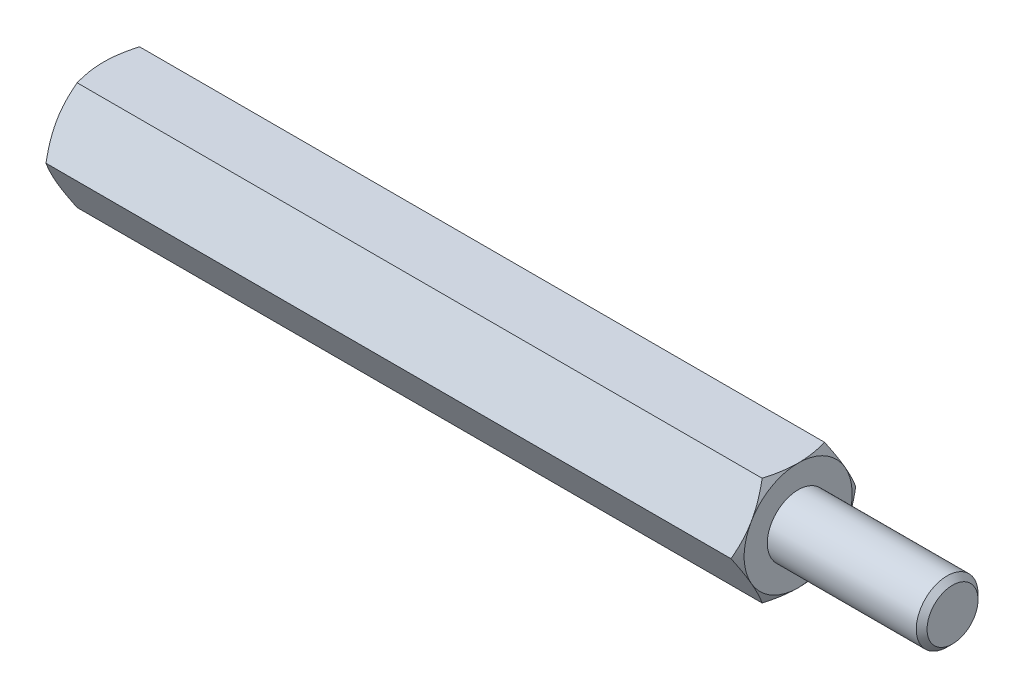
ISO-10303-21;
HEADER;
FILE_DESCRIPTION(('STEP AP214'),'2;1');
FILE_NAME('part.step','',(''),(''),'','','');
FILE_SCHEMA(('AUTOMOTIVE_DESIGN { 1 0 10303 214 1 1 1 1 }'));
ENDSEC;
DATA;
#1=APPLICATION_CONTEXT('core data for automotive mechanical design processes');
#2=APPLICATION_PROTOCOL_DEFINITION('international standard','automotive_design',2000,#1);
#3=PRODUCT_CONTEXT('',#1,'mechanical');
#4=PRODUCT('Part','Part','',(#3));
#5=PRODUCT_RELATED_PRODUCT_CATEGORY('part','',(#4));
#6=PRODUCT_DEFINITION_FORMATION('','',#4);
#7=PRODUCT_DEFINITION_CONTEXT('part definition',#1,'design');
#8=PRODUCT_DEFINITION('design','',#6,#7);
#9=PRODUCT_DEFINITION_SHAPE('','',#8);
#10=(LENGTH_UNIT() NAMED_UNIT(*) SI_UNIT(.MILLI.,.METRE.));
#11=(NAMED_UNIT(*) PLANE_ANGLE_UNIT() SI_UNIT($,.RADIAN.));
#12=(NAMED_UNIT(*) SI_UNIT($,.STERADIAN.) SOLID_ANGLE_UNIT());
#13=UNCERTAINTY_MEASURE_WITH_UNIT(LENGTH_MEASURE(1.E-05),#10,'distance_accuracy_value','');
#14=(GEOMETRIC_REPRESENTATION_CONTEXT(3) GLOBAL_UNCERTAINTY_ASSIGNED_CONTEXT((#13)) GLOBAL_UNIT_ASSIGNED_CONTEXT((#10,
#11,#12)) REPRESENTATION_CONTEXT('',''));
#15=CARTESIAN_POINT('',(0.,0.,0.));
#16=DIRECTION('',(0.,0.,1.));
#17=DIRECTION('',(1.,0.,0.));
#18=AXIS2_PLACEMENT_3D('',#15,#16,#17);
#19=CARTESIAN_POINT('',(22.5,3.5,-2.02072594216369));
#20=DIRECTION('',(1.,0.,0.));
#21=DIRECTION('',(0.,0.,-1.));
#22=AXIS2_PLACEMENT_3D('',#19,#20,#21);
#23=PLANE('',#22);
#24=CARTESIAN_POINT('',(22.5,0.,0.));
#25=DIRECTION('',(1.,0.,0.));
#26=DIRECTION('',(0.,0.,-1.));
#27=AXIS2_PLACEMENT_3D('',#24,#25,#26);
#28=CIRCLE('',#27,3.5);
#29=CARTESIAN_POINT('',(22.5,-1.75,-3.03108891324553));
#30=VERTEX_POINT('',#29);
#31=CARTESIAN_POINT('',(22.5,1.75,-3.03108891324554));
#32=VERTEX_POINT('',#31);
#33=EDGE_CURVE('E288',#30,#32,#28,.T.);
#34=ORIENTED_EDGE('',*,*,#33,.T.);
#35=CARTESIAN_POINT('',(22.5,3.5,0.));
#36=VERTEX_POINT('',#35);
#37=EDGE_CURVE('E53',#32,#36,#28,.T.);
#38=ORIENTED_EDGE('',*,*,#37,.T.);
#39=CARTESIAN_POINT('',(22.5,1.75,3.03108891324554));
#40=VERTEX_POINT('',#39);
#41=EDGE_CURVE('E297',#36,#40,#28,.T.);
#42=ORIENTED_EDGE('',*,*,#41,.T.);
#43=CARTESIAN_POINT('',(22.5,-1.75000000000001,3.03108891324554));
#44=VERTEX_POINT('',#43);
#45=EDGE_CURVE('E303',#40,#44,#28,.T.);
#46=ORIENTED_EDGE('',*,*,#45,.T.);
#47=CARTESIAN_POINT('',(22.5,0.,0.));
#48=DIRECTION('',(-1.,0.,0.));
#49=DIRECTION('',(0.,-1.,0.));
#50=AXIS2_PLACEMENT_3D('',#47,#48,#49);
#51=CIRCLE('',#50,3.5);
#52=CARTESIAN_POINT('',(22.5,-3.50000000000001,0.));
#53=VERTEX_POINT('',#52);
#54=EDGE_CURVE('E193',#53,#44,#51,.T.);
#55=ORIENTED_EDGE('',*,*,#54,.F.);
#56=EDGE_CURVE('E61',#53,#30,#28,.T.);
#57=ORIENTED_EDGE('',*,*,#56,.T.);
#58=EDGE_LOOP('',(#34,#38,#42,#46,#55,#57));
#59=FACE_BOUND('',#58,.T.);
#60=CARTESIAN_POINT('',(22.5,0.,0.));
#61=DIRECTION('',(1.,0.,0.));
#62=DIRECTION('',(0.,0.,-1.));
#63=AXIS2_PLACEMENT_3D('',#60,#61,#62);
#64=CIRCLE('',#63,2.);
#65=CARTESIAN_POINT('',(22.5,0.,-2.));
#66=VERTEX_POINT('',#65);
#67=EDGE_CURVE('E316',#66,#66,#64,.T.);
#68=ORIENTED_EDGE('',*,*,#67,.F.);
#69=EDGE_LOOP('',(#68));
#70=FACE_BOUND('',#69,.T.);
#71=ADVANCED_FACE('F37',(#59,#70),#23,.T.);
#72=CARTESIAN_POINT('',(22.5,0.,-4.04145188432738));
#73=DIRECTION('',(0.,-0.5,0.866025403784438));
#74=DIRECTION('',(0.,-0.866025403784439,-0.5));
#75=AXIS2_PLACEMENT_3D('',#72,#73,#74);
#76=PLANE('',#75);
#77=CARTESIAN_POINT('',(22.1873259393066,-0.000200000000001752,-4.04156735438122));
#78=CARTESIAN_POINT('',(22.23861421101,0.153607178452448,-3.9527667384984));
#79=CARTESIAN_POINT('',(22.2852590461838,0.308742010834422,-3.86319960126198));
#80=CARTESIAN_POINT('',(22.3666781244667,0.621698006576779,-3.68251437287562));
#81=CARTESIAN_POINT('',(22.4014235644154,0.779524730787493,-3.59139307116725));
#82=CARTESIAN_POINT('',(22.4555099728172,1.09322221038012,-3.41027974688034));
#83=CARTESIAN_POINT('',(22.4752109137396,1.24904469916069,-3.32031559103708));
#84=CARTESIAN_POINT('',(22.4987298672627,1.56142288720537,-3.13996396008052));
#85=CARTESIAN_POINT('',(22.5025673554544,1.71797745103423,-3.04957714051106));
#86=CARTESIAN_POINT('',(22.494584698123,2.01050921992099,-2.88068384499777));
#87=CARTESIAN_POINT('',(22.4847245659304,2.1465302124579,-2.80215208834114));
#88=CARTESIAN_POINT('',(22.4534735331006,2.41768602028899,-2.64560020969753));
#89=CARTESIAN_POINT('',(22.4320719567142,2.55281989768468,-2.5675806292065));
#90=CARTESIAN_POINT('',(22.3785695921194,2.82453479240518,-2.41070596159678));
#91=CARTESIAN_POINT('',(22.3462420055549,2.96108141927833,-2.33187072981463));
#92=CARTESIAN_POINT('',(22.272871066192,3.2321380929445,-2.17537608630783));
#93=CARTESIAN_POINT('',(22.2318449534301,3.36665161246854,-2.09771466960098));
#94=CARTESIAN_POINT('',(22.1873259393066,3.5002,-2.02061047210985));
#95=B_SPLINE_CURVE_WITH_KNOTS('',3,(#77,#78,#79,#80,#81,#82,#83,#84,#85,#86,#87,#88,#89,#90,#91,
#92,#93,#94),.UNSPECIFIED.,.F.,.F.,(4,2,2,2,2,2,2,2,4),(0.,0.554793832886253,1.11092123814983,
1.65328467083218,2.19498204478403,2.6666513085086,3.13875761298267,3.6213361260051,
4.10296698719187),.UNSPECIFIED.);
#96=CARTESIAN_POINT('',(22.1873926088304,0.,-4.04145188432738));
#97=VERTEX_POINT('',#96);
#98=EDGE_CURVE('E381',#97,#32,#95,.T.);
#99=ORIENTED_EDGE('',*,*,#98,.F.);
#100=DIRECTION('',(-1.,0.,0.));
#101=VECTOR('',#100,1.);
#102=CARTESIAN_POINT('',(22.5,0.,-4.04145188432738));
#103=LINE('',#102,#101);
#104=CARTESIAN_POINT('',(-22.1873926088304,0.,-4.04145188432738));
#105=VERTEX_POINT('',#104);
#106=EDGE_CURVE('E264',#97,#105,#103,.T.);
#107=ORIENTED_EDGE('',*,*,#106,.T.);
#108=CARTESIAN_POINT('',(-22.1873259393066,3.5002,-2.02061047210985));
#109=CARTESIAN_POINT('',(-22.23861421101,3.34639282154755,-2.10941108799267));
#110=CARTESIAN_POINT('',(-22.2852590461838,3.19125798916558,-2.19897822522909));
#111=CARTESIAN_POINT('',(-22.3666781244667,2.87830199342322,-2.37966345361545));
#112=CARTESIAN_POINT('',(-22.4014235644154,2.7204752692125,-2.47078475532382));
#113=CARTESIAN_POINT('',(-22.4555099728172,2.40677778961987,-2.65189807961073));
#114=CARTESIAN_POINT('',(-22.4752109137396,2.25095530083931,-2.74186223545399));
#115=CARTESIAN_POINT('',(-22.4987298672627,1.93857711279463,-2.92221386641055));
#116=CARTESIAN_POINT('',(-22.5025673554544,1.78202254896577,-3.01260068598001));
#117=CARTESIAN_POINT('',(-22.494584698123,1.48949078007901,-3.1814939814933));
#118=CARTESIAN_POINT('',(-22.4847245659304,1.35346978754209,-3.26002573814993));
#119=CARTESIAN_POINT('',(-22.4534735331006,1.082313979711,-3.41657761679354));
#120=CARTESIAN_POINT('',(-22.4320719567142,0.947180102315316,-3.49459719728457));
#121=CARTESIAN_POINT('',(-22.3785695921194,0.675465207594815,-3.65147186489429));
#122=CARTESIAN_POINT('',(-22.3462420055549,0.538918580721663,-3.73030709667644));
#123=CARTESIAN_POINT('',(-22.272871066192,0.267861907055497,-3.88680174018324));
#124=CARTESIAN_POINT('',(-22.2318449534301,0.133348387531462,-3.96446315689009));
#125=CARTESIAN_POINT('',(-22.1873259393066,-0.000200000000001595,-4.04156735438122));
#126=B_SPLINE_CURVE_WITH_KNOTS('',3,(#108,#109,#110,#111,#112,#113,#114,#115,#116,#117,#118,
#119,#120,#121,#122,#123,#124,#125),.UNSPECIFIED.,.F.,.F.,(4,2,2,2,2,2,2,2,4),(0.,
0.554793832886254,1.11092123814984,1.65328467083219,2.19498204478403,2.6666513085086,
3.13875761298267,3.6213361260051,4.10296698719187),.UNSPECIFIED.);
#127=CARTESIAN_POINT('',(-22.5,1.75,-3.03108891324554));
#128=VERTEX_POINT('',#127);
#129=EDGE_CURVE('E361',#128,#105,#126,.T.);
#130=ORIENTED_EDGE('',*,*,#129,.F.);
#131=CARTESIAN_POINT('',(-22.1873926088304,3.5,-2.02072594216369));
#132=VERTEX_POINT('',#131);
#133=EDGE_CURVE('E350',#132,#128,#126,.T.);
#134=ORIENTED_EDGE('',*,*,#133,.F.);
#135=DIRECTION('',(-1.,0.,0.));
#136=VECTOR('',#135,1.);
#137=CARTESIAN_POINT('',(22.5,3.5,-2.02072594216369));
#138=LINE('',#137,#136);
#139=CARTESIAN_POINT('',(22.1873926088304,3.5,-2.02072594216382));
#140=VERTEX_POINT('',#139);
#141=EDGE_CURVE('E279',#140,#132,#138,.T.);
#142=ORIENTED_EDGE('',*,*,#141,.F.);
#143=EDGE_CURVE('E229',#32,#140,#95,.T.);
#144=ORIENTED_EDGE('',*,*,#143,.F.);
#145=EDGE_LOOP('',(#99,#107,#130,#134,#142,#144));
#146=FACE_BOUND('',#145,.T.);
#147=ADVANCED_FACE('F148',(#146),#76,.F.);
#148=CARTESIAN_POINT('',(22.5,3.5,-2.02072594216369));
#149=DIRECTION('',(0.,-1.,0.));
#150=DIRECTION('',(0.,0.,-1.));
#151=AXIS2_PLACEMENT_3D('',#148,#149,#150);
#152=PLANE('',#151);
#153=CARTESIAN_POINT('',(20.7443294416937,3.5,-5.525713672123));
#154=CARTESIAN_POINT('',(20.8192813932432,3.5,-5.37200190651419));
#155=CARTESIAN_POINT('',(20.8935424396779,3.5,-5.21794762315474));
#156=CARTESIAN_POINT('',(21.0402960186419,3.5,-4.90897223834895));
#157=CARTESIAN_POINT('',(21.1127882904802,3.5,-4.75405101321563));
#158=CARTESIAN_POINT('',(21.2559617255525,3.5,-4.44240758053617));
#159=CARTESIAN_POINT('',(21.3266316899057,3.5,-4.28568021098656));
#160=CARTESIAN_POINT('',(21.4652074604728,3.5,-3.97101270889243));
#161=CARTESIAN_POINT('',(21.5331133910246,3.5,-3.81307263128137));
#162=CARTESIAN_POINT('',(21.6677143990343,3.5,-3.49026114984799));
#163=CARTESIAN_POINT('',(21.7342871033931,3.5,-3.32533845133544));
#164=CARTESIAN_POINT('',(21.8626267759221,3.5,-2.99359992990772));
#165=CARTESIAN_POINT('',(21.9243932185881,3.5,-2.82678390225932));
#166=CARTESIAN_POINT('',(22.0415700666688,3.5,-2.49127529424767));
#167=CARTESIAN_POINT('',(22.0969925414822,3.5,-2.32258697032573));
#168=CARTESIAN_POINT('',(22.1997679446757,3.5,-1.98279215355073));
#169=CARTESIAN_POINT('',(22.2471233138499,3.5,-1.81168640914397));
#170=CARTESIAN_POINT('',(22.3312987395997,3.5,-1.46793354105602));
#171=CARTESIAN_POINT('',(22.3681796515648,3.5,-1.2953015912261));
#172=CARTESIAN_POINT('',(22.4293955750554,3.5,-0.94779164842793));
#173=CARTESIAN_POINT('',(22.453731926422,3.5,-0.772913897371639));
#174=CARTESIAN_POINT('',(22.4876038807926,3.5,-0.424108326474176));
#175=CARTESIAN_POINT('',(22.497337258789,3.5,-0.250200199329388));
#176=CARTESIAN_POINT('',(22.5017053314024,3.5,0.0978233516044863));
#177=CARTESIAN_POINT('',(22.4963399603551,3.5,0.271938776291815));
#178=CARTESIAN_POINT('',(22.4750118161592,3.5,0.564711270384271));
#179=CARTESIAN_POINT('',(22.4628919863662,3.5,0.683667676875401));
#180=CARTESIAN_POINT('',(22.4323080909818,3.5,0.920767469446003));
#181=CARTESIAN_POINT('',(22.4138432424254,3.5,1.03891075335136));
#182=CARTESIAN_POINT('',(22.3498956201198,3.5,1.39193174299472));
#183=CARTESIAN_POINT('',(22.2958695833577,3.5,1.62528232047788));
#184=CARTESIAN_POINT('',(22.2014515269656,3.5,1.97433825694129));
#185=CARTESIAN_POINT('',(22.1672900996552,3.5,2.09183268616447));
#186=CARTESIAN_POINT('',(22.095234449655,3.5,2.32568238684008));
#187=CARTESIAN_POINT('',(22.0573401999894,3.5,2.44203765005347));
#188=CARTESIAN_POINT('',(21.9784421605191,3.5,2.6736423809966));
#189=CARTESIAN_POINT('',(21.9374392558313,3.5,2.78889215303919));
#190=CARTESIAN_POINT('',(21.852824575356,3.5,3.01842460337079));
#191=CARTESIAN_POINT('',(21.8092128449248,3.5,3.1327072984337));
#192=CARTESIAN_POINT('',(21.6958241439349,3.5,3.42150510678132));
#193=CARTESIAN_POINT('',(21.6245636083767,3.5,3.59543696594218));
#194=CARTESIAN_POINT('',(21.4781026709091,3.5,3.94163961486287));
#195=CARTESIAN_POINT('',(21.4029019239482,3.5,4.11391025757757));
#196=CARTESIAN_POINT('',(21.2494252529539,3.5,4.45713072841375));
#197=CARTESIAN_POINT('',(21.1711484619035,3.5,4.62808016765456));
#198=CARTESIAN_POINT('',(21.012188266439,3.5,4.96885843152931));
#199=CARTESIAN_POINT('',(20.9315047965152,3.5,5.13868722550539));
#200=CARTESIAN_POINT('',(20.6863871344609,3.5,5.64726192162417));
#201=CARTESIAN_POINT('',(20.5190975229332,3.5,5.98463020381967));
#202=CARTESIAN_POINT('',(20.1795854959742,3.5,6.65678495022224));
#203=CARTESIAN_POINT('',(20.0073639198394,3.5,6.99157184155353));
#204=CARTESIAN_POINT('',(19.6760800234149,3.5,7.62749570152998));
#205=CARTESIAN_POINT('',(19.5173299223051,3.5,7.92879562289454));
#206=CARTESIAN_POINT('',(19.1977473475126,3.5,8.53030635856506));
#207=CARTESIAN_POINT('',(19.0369147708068,3.5,8.83051711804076));
#208=CARTESIAN_POINT('',(18.7141792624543,3.5,9.42918006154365));
#209=CARTESIAN_POINT('',(18.5522810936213,3.5,9.72763481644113));
#210=CARTESIAN_POINT('',(18.2272737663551,3.5,10.3238577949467));
#211=CARTESIAN_POINT('',(18.0641646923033,3.5,10.6216260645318));
#212=CARTESIAN_POINT('',(17.9006104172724,3.5,10.9191478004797));
#213=B_SPLINE_CURVE_WITH_KNOTS('',3,(#153,#154,#155,#156,#157,#158,#159,#160,#161,#162,#163,
#164,#165,#166,#167,#168,#169,#170,#171,#172,#173,#174,#175,#176,#177,#178,#179,#180,#181,#182,
#183,#184,#185,#186,#187,#188,#189,#190,#191,#192,#193,#194,#195,#196,#197,#198,#199,#200,#201,
#202,#203,#204,#205,#206,#207,#208,#209,#210,#211,#212),.UNSPECIFIED.,.F.,.F.,(4,2,2,2,2,2,2,2,
2,2,2,2,2,2,2,2,2,2,2,2,2,2,2,2,2,2,2,2,2,4),(0.,0.513041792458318,1.02615874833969,
1.54190801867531,2.05763406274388,2.59113284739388,3.1246898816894,3.65721433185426,
4.18957737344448,4.71878103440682,5.24792816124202,5.76984197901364,6.29175806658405,
6.6503025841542,7.00889136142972,7.72642330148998,8.0934692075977,8.46051776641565,
8.82746220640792,9.19440026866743,9.75822236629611,10.3220939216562,10.8861255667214,
11.4501725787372,12.579801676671,13.7092396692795,14.730918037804,15.7526471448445,
16.771258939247,17.7898004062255),.UNSPECIFIED.);
#214=EDGE_CURVE('E227',#140,#36,#213,.T.);
#215=ORIENTED_EDGE('',*,*,#214,.F.);
#216=ORIENTED_EDGE('',*,*,#141,.T.);
#217=CARTESIAN_POINT('',(-20.7443294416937,3.5,-5.525713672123));
#218=CARTESIAN_POINT('',(-20.8192813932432,3.5,-5.37200190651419));
#219=CARTESIAN_POINT('',(-20.8935424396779,3.5,-5.21794762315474));
#220=CARTESIAN_POINT('',(-21.0402960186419,3.5,-4.90897223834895));
#221=CARTESIAN_POINT('',(-21.1127882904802,3.5,-4.75405101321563));
#222=CARTESIAN_POINT('',(-21.2559617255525,3.5,-4.44240758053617));
#223=CARTESIAN_POINT('',(-21.3266316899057,3.5,-4.28568021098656));
#224=CARTESIAN_POINT('',(-21.4652074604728,3.5,-3.97101270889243));
#225=CARTESIAN_POINT('',(-21.5331133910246,3.5,-3.81307263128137));
#226=CARTESIAN_POINT('',(-21.6677143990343,3.5,-3.49026114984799));
#227=CARTESIAN_POINT('',(-21.7342871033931,3.5,-3.32533845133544));
#228=CARTESIAN_POINT('',(-21.8626267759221,3.5,-2.99359992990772));
#229=CARTESIAN_POINT('',(-21.9243932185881,3.5,-2.82678390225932));
#230=CARTESIAN_POINT('',(-22.0415700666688,3.5,-2.49127529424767));
#231=CARTESIAN_POINT('',(-22.0969925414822,3.5,-2.32258697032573));
#232=CARTESIAN_POINT('',(-22.1997679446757,3.5,-1.98279215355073));
#233=CARTESIAN_POINT('',(-22.2471233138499,3.5,-1.81168640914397));
#234=CARTESIAN_POINT('',(-22.3312987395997,3.5,-1.46793354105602));
#235=CARTESIAN_POINT('',(-22.3681796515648,3.5,-1.2953015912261));
#236=CARTESIAN_POINT('',(-22.4293955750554,3.5,-0.94779164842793));
#237=CARTESIAN_POINT('',(-22.453731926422,3.5,-0.772913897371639));
#238=CARTESIAN_POINT('',(-22.4876038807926,3.5,-0.424108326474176));
#239=CARTESIAN_POINT('',(-22.497337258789,3.5,-0.250200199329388));
#240=CARTESIAN_POINT('',(-22.5017053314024,3.5,0.0978233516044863));
#241=CARTESIAN_POINT('',(-22.4963399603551,3.5,0.271938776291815));
#242=CARTESIAN_POINT('',(-22.4750118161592,3.5,0.564711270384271));
#243=CARTESIAN_POINT('',(-22.4628919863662,3.5,0.683667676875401));
#244=CARTESIAN_POINT('',(-22.4323080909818,3.5,0.920767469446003));
#245=CARTESIAN_POINT('',(-22.4138432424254,3.5,1.03891075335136));
#246=CARTESIAN_POINT('',(-22.3498956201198,3.5,1.39193174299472));
#247=CARTESIAN_POINT('',(-22.2958695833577,3.5,1.62528232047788));
#248=CARTESIAN_POINT('',(-22.2014515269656,3.5,1.97433825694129));
#249=CARTESIAN_POINT('',(-22.1672900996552,3.5,2.09183268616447));
#250=CARTESIAN_POINT('',(-22.095234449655,3.5,2.32568238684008));
#251=CARTESIAN_POINT('',(-22.0573401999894,3.5,2.44203765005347));
#252=CARTESIAN_POINT('',(-21.9784421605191,3.5,2.6736423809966));
#253=CARTESIAN_POINT('',(-21.9374392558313,3.5,2.78889215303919));
#254=CARTESIAN_POINT('',(-21.852824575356,3.5,3.01842460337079));
#255=CARTESIAN_POINT('',(-21.8092128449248,3.5,3.1327072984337));
#256=CARTESIAN_POINT('',(-21.6958241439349,3.5,3.42150510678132));
#257=CARTESIAN_POINT('',(-21.6245636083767,3.5,3.59543696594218));
#258=CARTESIAN_POINT('',(-21.4781026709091,3.5,3.94163961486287));
#259=CARTESIAN_POINT('',(-21.4029019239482,3.5,4.11391025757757));
#260=CARTESIAN_POINT('',(-21.2494252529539,3.5,4.45713072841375));
#261=CARTESIAN_POINT('',(-21.1711484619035,3.5,4.62808016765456));
#262=CARTESIAN_POINT('',(-21.012188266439,3.5,4.96885843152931));
#263=CARTESIAN_POINT('',(-20.9315047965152,3.5,5.13868722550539));
#264=CARTESIAN_POINT('',(-20.6863871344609,3.5,5.64726192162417));
#265=CARTESIAN_POINT('',(-20.5190975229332,3.5,5.98463020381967));
#266=CARTESIAN_POINT('',(-20.1795854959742,3.5,6.65678495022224));
#267=CARTESIAN_POINT('',(-20.0073639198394,3.5,6.99157184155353));
#268=CARTESIAN_POINT('',(-19.6760800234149,3.5,7.62749570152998));
#269=CARTESIAN_POINT('',(-19.5173299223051,3.5,7.92879562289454));
#270=CARTESIAN_POINT('',(-19.1977473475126,3.5,8.53030635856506));
#271=CARTESIAN_POINT('',(-19.0369147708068,3.5,8.83051711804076));
#272=CARTESIAN_POINT('',(-18.7141792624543,3.5,9.42918006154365));
#273=CARTESIAN_POINT('',(-18.5522810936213,3.5,9.72763481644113));
#274=CARTESIAN_POINT('',(-18.2272737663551,3.5,10.3238577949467));
#275=CARTESIAN_POINT('',(-18.0641646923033,3.5,10.6216260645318));
#276=CARTESIAN_POINT('',(-17.9006104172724,3.5,10.9191478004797));
#277=B_SPLINE_CURVE_WITH_KNOTS('',3,(#217,#218,#219,#220,#221,#222,#223,#224,#225,#226,#227,
#228,#229,#230,#231,#232,#233,#234,#235,#236,#237,#238,#239,#240,#241,#242,#243,#244,#245,#246,
#247,#248,#249,#250,#251,#252,#253,#254,#255,#256,#257,#258,#259,#260,#261,#262,#263,#264,#265,
#266,#267,#268,#269,#270,#271,#272,#273,#274,#275,#276),.UNSPECIFIED.,.F.,.F.,(4,2,2,2,2,2,2,2,
2,2,2,2,2,2,2,2,2,2,2,2,2,2,2,2,2,2,2,2,2,4),(0.,0.513041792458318,1.02615874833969,
1.54190801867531,2.05763406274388,2.59113284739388,3.1246898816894,3.65721433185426,
4.18957737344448,4.71878103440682,5.24792816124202,5.76984197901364,6.29175806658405,
6.6503025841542,7.00889136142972,7.72642330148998,8.0934692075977,8.46051776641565,
8.82746220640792,9.19440026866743,9.75822236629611,10.3220939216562,10.8861255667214,
11.4501725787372,12.579801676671,13.7092396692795,14.730918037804,15.7526471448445,
16.771258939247,17.7898004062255),.UNSPECIFIED.);
#278=CARTESIAN_POINT('',(-22.5,3.5,0.));
#279=VERTEX_POINT('',#278);
#280=EDGE_CURVE('E241',#279,#132,#277,.F.);
#281=ORIENTED_EDGE('',*,*,#280,.F.);
#282=CARTESIAN_POINT('',(-22.1873926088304,3.5,2.02072594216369));
#283=VERTEX_POINT('',#282);
#284=EDGE_CURVE('E249',#283,#279,#277,.F.);
#285=ORIENTED_EDGE('',*,*,#284,.F.);
#286=DIRECTION('',(-1.,0.,0.));
#287=VECTOR('',#286,1.);
#288=CARTESIAN_POINT('',(22.5,3.5,2.02072594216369));
#289=LINE('',#288,#287);
#290=CARTESIAN_POINT('',(22.1873926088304,3.5,2.02072594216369));
#291=VERTEX_POINT('',#290);
#292=EDGE_CURVE('E276',#291,#283,#289,.T.);
#293=ORIENTED_EDGE('',*,*,#292,.F.);
#294=EDGE_CURVE('E221',#36,#291,#213,.T.);
#295=ORIENTED_EDGE('',*,*,#294,.F.);
#296=EDGE_LOOP('',(#215,#216,#281,#285,#293,#295));
#297=FACE_BOUND('',#296,.T.);
#298=ADVANCED_FACE('F153',(#297),#152,.F.);
#299=CARTESIAN_POINT('',(22.5,3.5,2.02072594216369));
#300=DIRECTION('',(0.,-0.5,-0.866025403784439));
#301=DIRECTION('',(0.,0.866025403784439,-0.5));
#302=AXIS2_PLACEMENT_3D('',#299,#300,#301);
#303=PLANE('',#302);
#304=CARTESIAN_POINT('',(22.1873259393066,3.5002,2.02061047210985));
#305=CARTESIAN_POINT('',(22.23861421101,3.34639282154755,2.10941108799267));
#306=CARTESIAN_POINT('',(22.2852590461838,3.19125798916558,2.19897822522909));
#307=CARTESIAN_POINT('',(22.3666781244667,2.87830199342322,2.37966345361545));
#308=CARTESIAN_POINT('',(22.4014235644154,2.7204752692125,2.47078475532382));
#309=CARTESIAN_POINT('',(22.4555099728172,2.40677778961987,2.65189807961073));
#310=CARTESIAN_POINT('',(22.4752109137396,2.25095530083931,2.74186223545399));
#311=CARTESIAN_POINT('',(22.4987298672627,1.93857711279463,2.92221386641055));
#312=CARTESIAN_POINT('',(22.5025673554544,1.78202254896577,3.01260068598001));
#313=CARTESIAN_POINT('',(22.494584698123,1.48949078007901,3.1814939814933));
#314=CARTESIAN_POINT('',(22.4847245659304,1.35346978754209,3.26002573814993));
#315=CARTESIAN_POINT('',(22.4534735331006,1.08231397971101,3.41657761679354));
#316=CARTESIAN_POINT('',(22.4320719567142,0.947180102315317,3.49459719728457));
#317=CARTESIAN_POINT('',(22.3785695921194,0.675465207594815,3.65147186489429));
#318=CARTESIAN_POINT('',(22.3462420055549,0.538918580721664,3.73030709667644));
#319=CARTESIAN_POINT('',(22.272871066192,0.267861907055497,3.88680174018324));
#320=CARTESIAN_POINT('',(22.2318449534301,0.133348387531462,3.96446315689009));
#321=CARTESIAN_POINT('',(22.1873259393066,-0.000200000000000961,4.04156735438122));
#322=B_SPLINE_CURVE_WITH_KNOTS('',3,(#304,#305,#306,#307,#308,#309,#310,#311,#312,#313,#314,
#315,#316,#317,#318,#319,#320,#321),.UNSPECIFIED.,.F.,.F.,(4,2,2,2,2,2,2,2,4),(0.,
0.554793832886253,1.11092123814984,1.65328467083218,2.19498204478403,2.6666513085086,
3.13875761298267,3.6213361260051,4.10296698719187),.UNSPECIFIED.);
#323=EDGE_CURVE('E228',#291,#40,#322,.T.);
#324=ORIENTED_EDGE('',*,*,#323,.F.);
#325=ORIENTED_EDGE('',*,*,#292,.T.);
#326=CARTESIAN_POINT('',(-22.1873259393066,-0.000200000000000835,4.04156735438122));
#327=CARTESIAN_POINT('',(-22.23861421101,0.153607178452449,3.9527667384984));
#328=CARTESIAN_POINT('',(-22.2852590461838,0.308742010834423,3.86319960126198));
#329=CARTESIAN_POINT('',(-22.3666781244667,0.62169800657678,3.68251437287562));
#330=CARTESIAN_POINT('',(-22.4014235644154,0.779524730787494,3.59139307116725));
#331=CARTESIAN_POINT('',(-22.4555099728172,1.09322221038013,3.41027974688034));
#332=CARTESIAN_POINT('',(-22.4752109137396,1.24904469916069,3.32031559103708));
#333=CARTESIAN_POINT('',(-22.4987298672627,1.56142288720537,3.13996396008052));
#334=CARTESIAN_POINT('',(-22.5025673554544,1.71797745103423,3.04957714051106));
#335=CARTESIAN_POINT('',(-22.494584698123,2.01050921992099,2.88068384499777));
#336=CARTESIAN_POINT('',(-22.4847245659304,2.1465302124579,2.80215208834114));
#337=CARTESIAN_POINT('',(-22.4534735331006,2.41768602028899,2.64560020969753));
#338=CARTESIAN_POINT('',(-22.4320719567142,2.55281989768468,2.5675806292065));
#339=CARTESIAN_POINT('',(-22.3785695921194,2.82453479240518,2.41070596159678));
#340=CARTESIAN_POINT('',(-22.3462420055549,2.96108141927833,2.33187072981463));
#341=CARTESIAN_POINT('',(-22.272871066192,3.2321380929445,2.17537608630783));
#342=CARTESIAN_POINT('',(-22.2318449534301,3.36665161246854,2.09771466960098));
#343=CARTESIAN_POINT('',(-22.1873259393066,3.5002,2.02061047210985));
#344=B_SPLINE_CURVE_WITH_KNOTS('',3,(#326,#327,#328,#329,#330,#331,#332,#333,#334,#335,#336,
#337,#338,#339,#340,#341,#342,#343),.UNSPECIFIED.,.F.,.F.,(4,2,2,2,2,2,2,2,4),(0.,
0.554793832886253,1.11092123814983,1.65328467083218,2.19498204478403,2.6666513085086,
3.13875761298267,3.62133612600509,4.10296698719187),.UNSPECIFIED.);
#345=CARTESIAN_POINT('',(-22.5,1.75,3.03108891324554));
#346=VERTEX_POINT('',#345);
#347=EDGE_CURVE('E255',#346,#283,#344,.T.);
#348=ORIENTED_EDGE('',*,*,#347,.F.);
#349=CARTESIAN_POINT('',(-22.1873926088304,0.,4.04145188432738));
#350=VERTEX_POINT('',#349);
#351=EDGE_CURVE('E262',#350,#346,#344,.T.);
#352=ORIENTED_EDGE('',*,*,#351,.F.);
#353=DIRECTION('',(-1.,0.,0.));
#354=VECTOR('',#353,1.);
#355=CARTESIAN_POINT('',(22.5,0.,4.04145188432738));
#356=LINE('',#355,#354);
#357=CARTESIAN_POINT('',(22.1873926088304,0.,4.04145188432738));
#358=VERTEX_POINT('',#357);
#359=EDGE_CURVE('E273',#358,#350,#356,.T.);
#360=ORIENTED_EDGE('',*,*,#359,.F.);
#361=EDGE_CURVE('E215',#40,#358,#322,.T.);
#362=ORIENTED_EDGE('',*,*,#361,.F.);
#363=EDGE_LOOP('',(#324,#325,#348,#352,#360,#362));
#364=FACE_BOUND('',#363,.T.);
#365=ADVANCED_FACE('F235',(#364),#303,.F.);
#366=CARTESIAN_POINT('',(22.5,0.,4.04145188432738));
#367=DIRECTION('',(0.,0.5,-0.866025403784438));
#368=DIRECTION('',(0.,0.866025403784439,0.5));
#369=AXIS2_PLACEMENT_3D('',#366,#367,#368);
#370=PLANE('',#369);
#371=CARTESIAN_POINT('',(22.1873259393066,0.000199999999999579,4.04156735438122));
#372=CARTESIAN_POINT('',(22.23861421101,-0.15360717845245,3.9527667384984));
#373=CARTESIAN_POINT('',(22.2852590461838,-0.308742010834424,3.86319960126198));
#374=CARTESIAN_POINT('',(22.3666781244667,-0.621698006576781,3.68251437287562));
#375=CARTESIAN_POINT('',(22.4014235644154,-0.779524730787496,3.59139307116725));
#376=CARTESIAN_POINT('',(22.4555099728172,-1.09322221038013,3.41027974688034));
#377=CARTESIAN_POINT('',(22.4752109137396,-1.24904469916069,3.32031559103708));
#378=CARTESIAN_POINT('',(22.4987298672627,-1.56142288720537,3.13996396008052));
#379=CARTESIAN_POINT('',(22.5025673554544,-1.71797745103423,3.04957714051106));
#380=CARTESIAN_POINT('',(22.494584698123,-2.01050921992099,2.88068384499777));
#381=CARTESIAN_POINT('',(22.4847245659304,-2.14653021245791,2.80215208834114));
#382=CARTESIAN_POINT('',(22.4534735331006,-2.41768602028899,2.64560020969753));
#383=CARTESIAN_POINT('',(22.4320719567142,-2.55281989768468,2.5675806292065));
#384=CARTESIAN_POINT('',(22.3785695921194,-2.82453479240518,2.41070596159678));
#385=CARTESIAN_POINT('',(22.3462420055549,-2.96108141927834,2.33187072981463));
#386=CARTESIAN_POINT('',(22.272871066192,-3.2321380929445,2.17537608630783));
#387=CARTESIAN_POINT('',(22.2318449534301,-3.36665161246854,2.09771466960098));
#388=CARTESIAN_POINT('',(22.1873259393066,-3.5002,2.02061047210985));
#389=B_SPLINE_CURVE_WITH_KNOTS('',3,(#371,#372,#373,#374,#375,#376,#377,#378,#379,#380,#381,
#382,#383,#384,#385,#386,#387,#388),.UNSPECIFIED.,.F.,.F.,(4,2,2,2,2,2,2,2,4),(0.,
0.554793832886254,1.11092123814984,1.65328467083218,2.19498204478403,2.6666513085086,
3.13875761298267,3.62133612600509,4.10296698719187),.UNSPECIFIED.);
#390=EDGE_CURVE('E394',#358,#44,#389,.T.);
#391=ORIENTED_EDGE('',*,*,#390,.F.);
#392=ORIENTED_EDGE('',*,*,#359,.T.);
#393=CARTESIAN_POINT('',(-22.1873259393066,-3.5002,2.02061047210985));
#394=CARTESIAN_POINT('',(-22.23861421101,-3.34639282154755,2.10941108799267));
#395=CARTESIAN_POINT('',(-22.2852590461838,-3.19125798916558,2.19897822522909));
#396=CARTESIAN_POINT('',(-22.3666781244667,-2.87830199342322,2.37966345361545));
#397=CARTESIAN_POINT('',(-22.4014235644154,-2.72047526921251,2.47078475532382));
#398=CARTESIAN_POINT('',(-22.4555099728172,-2.40677778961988,2.65189807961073));
#399=CARTESIAN_POINT('',(-22.4752109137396,-2.25095530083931,2.74186223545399));
#400=CARTESIAN_POINT('',(-22.4987298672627,-1.93857711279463,2.92221386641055));
#401=CARTESIAN_POINT('',(-22.5025673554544,-1.78202254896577,3.01260068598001));
#402=CARTESIAN_POINT('',(-22.494584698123,-1.48949078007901,3.1814939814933));
#403=CARTESIAN_POINT('',(-22.4847245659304,-1.3534697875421,3.26002573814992));
#404=CARTESIAN_POINT('',(-22.4534735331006,-1.08231397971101,3.41657761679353));
#405=CARTESIAN_POINT('',(-22.4320719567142,-0.94718010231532,3.49459719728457));
#406=CARTESIAN_POINT('',(-22.3785695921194,-0.675465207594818,3.65147186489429));
#407=CARTESIAN_POINT('',(-22.3462420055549,-0.538918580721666,3.73030709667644));
#408=CARTESIAN_POINT('',(-22.272871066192,-0.267861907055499,3.88680174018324));
#409=CARTESIAN_POINT('',(-22.2318449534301,-0.133348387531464,3.96446315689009));
#410=CARTESIAN_POINT('',(-22.1873259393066,0.000199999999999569,4.04156735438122));
#411=B_SPLINE_CURVE_WITH_KNOTS('',3,(#393,#394,#395,#396,#397,#398,#399,#400,#401,#402,#403,
#404,#405,#406,#407,#408,#409,#410),.UNSPECIFIED.,.F.,.F.,(4,2,2,2,2,2,2,2,4),(0.,
0.554793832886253,1.11092123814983,1.65328467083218,2.19498204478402,2.66665130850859,
3.13875761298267,3.62133612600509,4.10296698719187),.UNSPECIFIED.);
#412=CARTESIAN_POINT('',(-22.5,-1.75000000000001,3.03108891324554));
#413=VERTEX_POINT('',#412);
#414=EDGE_CURVE('E263',#413,#350,#411,.T.);
#415=ORIENTED_EDGE('',*,*,#414,.F.);
#416=CARTESIAN_POINT('',(-22.1873926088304,-3.5,2.02072594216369));
#417=VERTEX_POINT('',#416);
#418=EDGE_CURVE('E250',#417,#413,#411,.T.);
#419=ORIENTED_EDGE('',*,*,#418,.F.);
#420=DIRECTION('',(-1.,0.,0.));
#421=VECTOR('',#420,1.);
#422=CARTESIAN_POINT('',(22.5,-3.5,2.02072594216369));
#423=LINE('',#422,#421);
#424=CARTESIAN_POINT('',(22.1873926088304,-3.5,2.02072594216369));
#425=VERTEX_POINT('',#424);
#426=EDGE_CURVE('E270',#425,#417,#423,.T.);
#427=ORIENTED_EDGE('',*,*,#426,.F.);
#428=EDGE_CURVE('E210',#44,#425,#389,.T.);
#429=ORIENTED_EDGE('',*,*,#428,.F.);
#430=EDGE_LOOP('',(#391,#392,#415,#419,#427,#429));
#431=FACE_BOUND('',#430,.T.);
#432=ADVANCED_FACE('F423',(#431),#370,.F.);
#433=CARTESIAN_POINT('',(22.5,-3.5,2.02072594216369));
#434=DIRECTION('',(0.,1.,0.));
#435=DIRECTION('',(0.,0.,1.));
#436=AXIS2_PLACEMENT_3D('',#433,#434,#435);
#437=PLANE('',#436);
#438=CARTESIAN_POINT('',(20.7443294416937,-3.5,-5.52571367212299));
#439=CARTESIAN_POINT('',(20.8192813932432,-3.5,-5.37200190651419));
#440=CARTESIAN_POINT('',(20.8935424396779,-3.5,-5.21794762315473));
#441=CARTESIAN_POINT('',(21.0402960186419,-3.5,-4.90897223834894));
#442=CARTESIAN_POINT('',(21.1127882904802,-3.5,-4.75405101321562));
#443=CARTESIAN_POINT('',(21.2559617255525,-3.5,-4.44240758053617));
#444=CARTESIAN_POINT('',(21.3266316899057,-3.5,-4.28568021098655));
#445=CARTESIAN_POINT('',(21.4652074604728,-3.5,-3.97101270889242));
#446=CARTESIAN_POINT('',(21.5331133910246,-3.5,-3.81307263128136));
#447=CARTESIAN_POINT('',(21.6677143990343,-3.5,-3.49026114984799));
#448=CARTESIAN_POINT('',(21.7342871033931,-3.5,-3.32533845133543));
#449=CARTESIAN_POINT('',(21.8626267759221,-3.5,-2.99359992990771));
#450=CARTESIAN_POINT('',(21.9243932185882,-3.5,-2.82678390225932));
#451=CARTESIAN_POINT('',(22.0415700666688,-3.5,-2.49127529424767));
#452=CARTESIAN_POINT('',(22.0969925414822,-3.5,-2.32258697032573));
#453=CARTESIAN_POINT('',(22.1997679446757,-3.5,-1.98279215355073));
#454=CARTESIAN_POINT('',(22.2471233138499,-3.5,-1.81168640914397));
#455=CARTESIAN_POINT('',(22.3312987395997,-3.5,-1.46793354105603));
#456=CARTESIAN_POINT('',(22.3681796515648,-3.5,-1.2953015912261));
#457=CARTESIAN_POINT('',(22.4293955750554,-3.5,-0.947791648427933));
#458=CARTESIAN_POINT('',(22.453731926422,-3.5,-0.772913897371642));
#459=CARTESIAN_POINT('',(22.4876038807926,-3.5,-0.42410832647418));
#460=CARTESIAN_POINT('',(22.497337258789,-3.5,-0.250200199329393));
#461=CARTESIAN_POINT('',(22.5017053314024,-3.5,0.0978233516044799));
#462=CARTESIAN_POINT('',(22.4963399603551,-3.5,0.271938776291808));
#463=CARTESIAN_POINT('',(22.4750118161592,-3.5,0.564711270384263));
#464=CARTESIAN_POINT('',(22.4628919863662,-3.5,0.683667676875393));
#465=CARTESIAN_POINT('',(22.4323080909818,-3.5,0.920767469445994));
#466=CARTESIAN_POINT('',(22.4138432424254,-3.5,1.03891075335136));
#467=CARTESIAN_POINT('',(22.3498956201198,-3.5,1.39193174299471));
#468=CARTESIAN_POINT('',(22.2958695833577,-3.5,1.62528232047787));
#469=CARTESIAN_POINT('',(22.2014515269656,-3.5,1.97433825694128));
#470=CARTESIAN_POINT('',(22.1672900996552,-3.5,2.09183268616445));
#471=CARTESIAN_POINT('',(22.095234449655,-3.5,2.32568238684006));
#472=CARTESIAN_POINT('',(22.0573401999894,-3.5,2.44203765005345));
#473=CARTESIAN_POINT('',(21.9784421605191,-3.5,2.67364238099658));
#474=CARTESIAN_POINT('',(21.9374392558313,-3.5,2.78889215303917));
#475=CARTESIAN_POINT('',(21.852824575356,-3.5,3.01842460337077));
#476=CARTESIAN_POINT('',(21.8092128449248,-3.5,3.13270729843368));
#477=CARTESIAN_POINT('',(21.6958241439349,-3.5,3.4215051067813));
#478=CARTESIAN_POINT('',(21.6245636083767,-3.5,3.59543696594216));
#479=CARTESIAN_POINT('',(21.4781026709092,-3.5,3.94163961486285));
#480=CARTESIAN_POINT('',(21.4029019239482,-3.5,4.11391025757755));
#481=CARTESIAN_POINT('',(21.2494252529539,-3.5,4.45713072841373));
#482=CARTESIAN_POINT('',(21.1711484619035,-3.5,4.62808016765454));
#483=CARTESIAN_POINT('',(21.0121882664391,-3.5,4.96885843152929));
#484=CARTESIAN_POINT('',(20.9315047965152,-3.5,5.13868722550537));
#485=CARTESIAN_POINT('',(20.6863871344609,-3.5,5.64726192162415));
#486=CARTESIAN_POINT('',(20.5190975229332,-3.5,5.98463020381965));
#487=CARTESIAN_POINT('',(20.1795854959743,-3.5,6.65678495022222));
#488=CARTESIAN_POINT('',(20.0073639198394,-3.5,6.99157184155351));
#489=CARTESIAN_POINT('',(19.6760800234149,-3.5,7.62749570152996));
#490=CARTESIAN_POINT('',(19.5173299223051,-3.5,7.92879562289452));
#491=CARTESIAN_POINT('',(19.1977473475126,-3.5,8.53030635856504));
#492=CARTESIAN_POINT('',(19.0369147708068,-3.5,8.83051711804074));
#493=CARTESIAN_POINT('',(18.7141792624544,-3.5,9.42918006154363));
#494=CARTESIAN_POINT('',(18.5522810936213,-3.5,9.72763481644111));
#495=CARTESIAN_POINT('',(18.2272737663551,-3.5,10.3238577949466));
#496=CARTESIAN_POINT('',(18.0641646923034,-3.5,10.6216260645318));
#497=CARTESIAN_POINT('',(17.9006104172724,-3.5,10.9191478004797));
#498=B_SPLINE_CURVE_WITH_KNOTS('',3,(#438,#439,#440,#441,#442,#443,#444,#445,#446,#447,#448,
#449,#450,#451,#452,#453,#454,#455,#456,#457,#458,#459,#460,#461,#462,#463,#464,#465,#466,#467,
#468,#469,#470,#471,#472,#473,#474,#475,#476,#477,#478,#479,#480,#481,#482,#483,#484,#485,#486,
#487,#488,#489,#490,#491,#492,#493,#494,#495,#496,#497),.UNSPECIFIED.,.F.,.F.,(4,2,2,2,2,2,2,2,
2,2,2,2,2,2,2,2,2,2,2,2,2,2,2,2,2,2,2,2,2,4),(0.,0.513041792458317,1.02615874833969,
1.54190801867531,2.05763406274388,2.59113284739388,3.1246898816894,3.65721433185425,
4.18957737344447,4.71878103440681,5.247928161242,5.76984197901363,6.29175806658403,
6.65030258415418,7.0088913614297,7.72642330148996,8.09346920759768,8.46051776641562,
8.8274622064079,9.19440026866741,9.75822236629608,10.3220939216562,10.8861255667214,
11.4501725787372,12.579801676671,13.7092396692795,14.730918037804,15.7526471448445,
16.7712589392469,17.7898004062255),.UNSPECIFIED.);
#499=EDGE_CURVE('E315',#425,#53,#498,.F.);
#500=ORIENTED_EDGE('',*,*,#499,.F.);
#501=ORIENTED_EDGE('',*,*,#426,.T.);
#502=CARTESIAN_POINT('',(-20.7443294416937,-3.5,-5.52571367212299));
#503=CARTESIAN_POINT('',(-20.8192813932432,-3.5,-5.37200190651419));
#504=CARTESIAN_POINT('',(-20.8935424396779,-3.5,-5.21794762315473));
#505=CARTESIAN_POINT('',(-21.0402960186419,-3.5,-4.90897223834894));
#506=CARTESIAN_POINT('',(-21.1127882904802,-3.5,-4.75405101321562));
#507=CARTESIAN_POINT('',(-21.2559617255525,-3.5,-4.44240758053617));
#508=CARTESIAN_POINT('',(-21.3266316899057,-3.5,-4.28568021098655));
#509=CARTESIAN_POINT('',(-21.4652074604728,-3.5,-3.97101270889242));
#510=CARTESIAN_POINT('',(-21.5331133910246,-3.5,-3.81307263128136));
#511=CARTESIAN_POINT('',(-21.6677143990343,-3.5,-3.49026114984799));
#512=CARTESIAN_POINT('',(-21.7342871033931,-3.5,-3.32533845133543));
#513=CARTESIAN_POINT('',(-21.8626267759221,-3.5,-2.99359992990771));
#514=CARTESIAN_POINT('',(-21.9243932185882,-3.5,-2.82678390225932));
#515=CARTESIAN_POINT('',(-22.0415700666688,-3.5,-2.49127529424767));
#516=CARTESIAN_POINT('',(-22.0969925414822,-3.5,-2.32258697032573));
#517=CARTESIAN_POINT('',(-22.1997679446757,-3.5,-1.98279215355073));
#518=CARTESIAN_POINT('',(-22.2471233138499,-3.5,-1.81168640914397));
#519=CARTESIAN_POINT('',(-22.3312987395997,-3.5,-1.46793354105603));
#520=CARTESIAN_POINT('',(-22.3681796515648,-3.5,-1.2953015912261));
#521=CARTESIAN_POINT('',(-22.4293955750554,-3.5,-0.947791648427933));
#522=CARTESIAN_POINT('',(-22.453731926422,-3.5,-0.772913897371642));
#523=CARTESIAN_POINT('',(-22.4876038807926,-3.5,-0.42410832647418));
#524=CARTESIAN_POINT('',(-22.497337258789,-3.5,-0.250200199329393));
#525=CARTESIAN_POINT('',(-22.5017053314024,-3.5,0.0978233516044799));
#526=CARTESIAN_POINT('',(-22.4963399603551,-3.5,0.271938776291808));
#527=CARTESIAN_POINT('',(-22.4750118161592,-3.5,0.564711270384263));
#528=CARTESIAN_POINT('',(-22.4628919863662,-3.5,0.683667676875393));
#529=CARTESIAN_POINT('',(-22.4323080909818,-3.5,0.920767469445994));
#530=CARTESIAN_POINT('',(-22.4138432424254,-3.5,1.03891075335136));
#531=CARTESIAN_POINT('',(-22.3498956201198,-3.5,1.39193174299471));
#532=CARTESIAN_POINT('',(-22.2958695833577,-3.5,1.62528232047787));
#533=CARTESIAN_POINT('',(-22.2014515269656,-3.5,1.97433825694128));
#534=CARTESIAN_POINT('',(-22.1672900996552,-3.5,2.09183268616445));
#535=CARTESIAN_POINT('',(-22.095234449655,-3.5,2.32568238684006));
#536=CARTESIAN_POINT('',(-22.0573401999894,-3.5,2.44203765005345));
#537=CARTESIAN_POINT('',(-21.9784421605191,-3.5,2.67364238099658));
#538=CARTESIAN_POINT('',(-21.9374392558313,-3.5,2.78889215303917));
#539=CARTESIAN_POINT('',(-21.852824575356,-3.5,3.01842460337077));
#540=CARTESIAN_POINT('',(-21.8092128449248,-3.5,3.13270729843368));
#541=CARTESIAN_POINT('',(-21.6958241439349,-3.5,3.4215051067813));
#542=CARTESIAN_POINT('',(-21.6245636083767,-3.5,3.59543696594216));
#543=CARTESIAN_POINT('',(-21.4781026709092,-3.5,3.94163961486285));
#544=CARTESIAN_POINT('',(-21.4029019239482,-3.5,4.11391025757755));
#545=CARTESIAN_POINT('',(-21.2494252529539,-3.5,4.45713072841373));
#546=CARTESIAN_POINT('',(-21.1711484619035,-3.5,4.62808016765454));
#547=CARTESIAN_POINT('',(-21.0121882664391,-3.5,4.96885843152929));
#548=CARTESIAN_POINT('',(-20.9315047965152,-3.5,5.13868722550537));
#549=CARTESIAN_POINT('',(-20.6863871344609,-3.5,5.64726192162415));
#550=CARTESIAN_POINT('',(-20.5190975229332,-3.5,5.98463020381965));
#551=CARTESIAN_POINT('',(-20.1795854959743,-3.5,6.65678495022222));
#552=CARTESIAN_POINT('',(-20.0073639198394,-3.5,6.99157184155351));
#553=CARTESIAN_POINT('',(-19.6760800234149,-3.5,7.62749570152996));
#554=CARTESIAN_POINT('',(-19.5173299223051,-3.5,7.92879562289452));
#555=CARTESIAN_POINT('',(-19.1977473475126,-3.5,8.53030635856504));
#556=CARTESIAN_POINT('',(-19.0369147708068,-3.5,8.83051711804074));
#557=CARTESIAN_POINT('',(-18.7141792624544,-3.5,9.42918006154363));
#558=CARTESIAN_POINT('',(-18.5522810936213,-3.5,9.72763481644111));
#559=CARTESIAN_POINT('',(-18.2272737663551,-3.5,10.3238577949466));
#560=CARTESIAN_POINT('',(-18.0641646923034,-3.5,10.6216260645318));
#561=CARTESIAN_POINT('',(-17.9006104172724,-3.5,10.9191478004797));
#562=B_SPLINE_CURVE_WITH_KNOTS('',3,(#502,#503,#504,#505,#506,#507,#508,#509,#510,#511,#512,
#513,#514,#515,#516,#517,#518,#519,#520,#521,#522,#523,#524,#525,#526,#527,#528,#529,#530,#531,
#532,#533,#534,#535,#536,#537,#538,#539,#540,#541,#542,#543,#544,#545,#546,#547,#548,#549,#550,
#551,#552,#553,#554,#555,#556,#557,#558,#559,#560,#561),.UNSPECIFIED.,.F.,.F.,(4,2,2,2,2,2,2,2,
2,2,2,2,2,2,2,2,2,2,2,2,2,2,2,2,2,2,2,2,2,4),(0.,0.513041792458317,1.02615874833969,
1.54190801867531,2.05763406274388,2.59113284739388,3.1246898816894,3.65721433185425,
4.18957737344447,4.71878103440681,5.247928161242,5.76984197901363,6.29175806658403,
6.65030258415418,7.0088913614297,7.72642330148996,8.09346920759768,8.46051776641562,
8.8274622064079,9.19440026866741,9.75822236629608,10.3220939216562,10.8861255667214,
11.4501725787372,12.579801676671,13.7092396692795,14.730918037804,15.7526471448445,
16.7712589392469,17.7898004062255),.UNSPECIFIED.);
#563=CARTESIAN_POINT('',(-22.5,-3.50000000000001,0.));
#564=VERTEX_POINT('',#563);
#565=EDGE_CURVE('E362',#564,#417,#562,.T.);
#566=ORIENTED_EDGE('',*,*,#565,.F.);
#567=CARTESIAN_POINT('',(-22.1873926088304,-3.5,-2.02072594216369));
#568=VERTEX_POINT('',#567);
#569=EDGE_CURVE('E364',#568,#564,#562,.T.);
#570=ORIENTED_EDGE('',*,*,#569,.F.);
#571=DIRECTION('',(-1.,0.,0.));
#572=VECTOR('',#571,1.);
#573=CARTESIAN_POINT('',(22.5,-3.5,-2.02072594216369));
#574=LINE('',#573,#572);
#575=CARTESIAN_POINT('',(22.1873926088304,-3.5,-2.02072594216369));
#576=VERTEX_POINT('',#575);
#577=EDGE_CURVE('E267',#576,#568,#574,.T.);
#578=ORIENTED_EDGE('',*,*,#577,.F.);
#579=EDGE_CURVE('E195',#53,#576,#498,.F.);
#580=ORIENTED_EDGE('',*,*,#579,.F.);
#581=EDGE_LOOP('',(#500,#501,#566,#570,#578,#580));
#582=FACE_BOUND('',#581,.T.);
#583=ADVANCED_FACE('F172',(#582),#437,.F.);
#584=CARTESIAN_POINT('',(22.5,-3.5,-2.02072594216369));
#585=DIRECTION('',(0.,0.5,0.866025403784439));
#586=DIRECTION('',(0.,-0.866025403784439,0.5));
#587=AXIS2_PLACEMENT_3D('',#584,#585,#586);
#588=PLANE('',#587);
#589=CARTESIAN_POINT('',(22.1873259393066,-3.5002,-2.02061047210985));
#590=CARTESIAN_POINT('',(22.23861421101,-3.34639282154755,-2.10941108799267));
#591=CARTESIAN_POINT('',(22.2852590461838,-3.19125798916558,-2.19897822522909));
#592=CARTESIAN_POINT('',(22.3666781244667,-2.87830199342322,-2.37966345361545));
#593=CARTESIAN_POINT('',(22.4014235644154,-2.72047526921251,-2.47078475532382));
#594=CARTESIAN_POINT('',(22.4555099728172,-2.40677778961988,-2.65189807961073));
#595=CARTESIAN_POINT('',(22.4752109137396,-2.25095530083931,-2.74186223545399));
#596=CARTESIAN_POINT('',(22.4987298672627,-1.93857711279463,-2.92221386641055));
#597=CARTESIAN_POINT('',(22.5025673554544,-1.78202254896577,-3.01260068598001));
#598=CARTESIAN_POINT('',(22.494584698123,-1.48949078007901,-3.1814939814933));
#599=CARTESIAN_POINT('',(22.4847245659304,-1.3534697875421,-3.26002573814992));
#600=CARTESIAN_POINT('',(22.4534735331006,-1.08231397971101,-3.41657761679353));
#601=CARTESIAN_POINT('',(22.4320719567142,-0.94718010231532,-3.49459719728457));
#602=CARTESIAN_POINT('',(22.3785695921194,-0.675465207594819,-3.65147186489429));
#603=CARTESIAN_POINT('',(22.3462420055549,-0.538918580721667,-3.73030709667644));
#604=CARTESIAN_POINT('',(22.272871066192,-0.2678619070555,-3.88680174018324));
#605=CARTESIAN_POINT('',(22.2318449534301,-0.133348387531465,-3.96446315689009));
#606=CARTESIAN_POINT('',(22.1873259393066,0.000199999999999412,-4.04156735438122));
#607=B_SPLINE_CURVE_WITH_KNOTS('',3,(#589,#590,#591,#592,#593,#594,#595,#596,#597,#598,#599,
#600,#601,#602,#603,#604,#605,#606),.UNSPECIFIED.,.F.,.F.,(4,2,2,2,2,2,2,2,4),(0.,
0.554793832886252,1.11092123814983,1.65328467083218,2.19498204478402,2.66665130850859,
3.13875761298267,3.62133612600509,4.10296698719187),.UNSPECIFIED.);
#608=EDGE_CURVE('E192',#576,#30,#607,.T.);
#609=ORIENTED_EDGE('',*,*,#608,.F.);
#610=ORIENTED_EDGE('',*,*,#577,.T.);
#611=CARTESIAN_POINT('',(-22.1873259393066,0.000199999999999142,-4.04156735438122));
#612=CARTESIAN_POINT('',(-22.23861421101,-0.15360717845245,-3.9527667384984));
#613=CARTESIAN_POINT('',(-22.2852590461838,-0.308742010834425,-3.86319960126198));
#614=CARTESIAN_POINT('',(-22.3666781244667,-0.621698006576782,-3.68251437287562));
#615=CARTESIAN_POINT('',(-22.4014235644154,-0.779524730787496,-3.59139307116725));
#616=CARTESIAN_POINT('',(-22.4555099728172,-1.09322221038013,-3.41027974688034));
#617=CARTESIAN_POINT('',(-22.4752109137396,-1.24904469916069,-3.32031559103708));
#618=CARTESIAN_POINT('',(-22.4987298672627,-1.56142288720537,-3.13996396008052));
#619=CARTESIAN_POINT('',(-22.5025673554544,-1.71797745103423,-3.04957714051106));
#620=CARTESIAN_POINT('',(-22.494584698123,-2.01050921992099,-2.88068384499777));
#621=CARTESIAN_POINT('',(-22.4847245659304,-2.14653021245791,-2.80215208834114));
#622=CARTESIAN_POINT('',(-22.4534735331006,-2.41768602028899,-2.64560020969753));
#623=CARTESIAN_POINT('',(-22.4320719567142,-2.55281989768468,-2.5675806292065));
#624=CARTESIAN_POINT('',(-22.3785695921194,-2.82453479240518,-2.41070596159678));
#625=CARTESIAN_POINT('',(-22.3462420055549,-2.96108141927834,-2.33187072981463));
#626=CARTESIAN_POINT('',(-22.272871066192,-3.2321380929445,-2.17537608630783));
#627=CARTESIAN_POINT('',(-22.2318449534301,-3.36665161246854,-2.09771466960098));
#628=CARTESIAN_POINT('',(-22.1873259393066,-3.5002,-2.02061047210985));
#629=B_SPLINE_CURVE_WITH_KNOTS('',3,(#611,#612,#613,#614,#615,#616,#617,#618,#619,#620,#621,
#622,#623,#624,#625,#626,#627,#628),.UNSPECIFIED.,.F.,.F.,(4,2,2,2,2,2,2,2,4),(0.,
0.554793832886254,1.11092123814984,1.65328467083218,2.19498204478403,2.6666513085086,
3.13875761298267,3.6213361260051,4.10296698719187),.UNSPECIFIED.);
#630=CARTESIAN_POINT('',(-22.5,-1.75,-3.03108891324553));
#631=VERTEX_POINT('',#630);
#632=EDGE_CURVE('E178',#631,#568,#629,.T.);
#633=ORIENTED_EDGE('',*,*,#632,.F.);
#634=EDGE_CURVE('E372',#105,#631,#629,.T.);
#635=ORIENTED_EDGE('',*,*,#634,.F.);
#636=ORIENTED_EDGE('',*,*,#106,.F.);
#637=EDGE_CURVE('E185',#30,#97,#607,.T.);
#638=ORIENTED_EDGE('',*,*,#637,.F.);
#639=EDGE_LOOP('',(#609,#610,#633,#635,#636,#638));
#640=FACE_BOUND('',#639,.T.);
#641=ADVANCED_FACE('F167',(#640),#588,.F.);
#642=CARTESIAN_POINT('',(-22.5,0.,0.));
#643=DIRECTION('',(1.,0.,0.));
#644=DIRECTION('',(0.,1.,0.));
#645=AXIS2_PLACEMENT_3D('',#642,#643,#644);
#646=CONICAL_SURFACE('',#645,3.5,1.0471975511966);
#647=ORIENTED_EDGE('',*,*,#129,.T.);
#648=ORIENTED_EDGE('',*,*,#634,.T.);
#649=CARTESIAN_POINT('',(-22.5,0.,0.));
#650=DIRECTION('',(1.,0.,0.));
#651=DIRECTION('',(0.,0.,-1.));
#652=AXIS2_PLACEMENT_3D('',#649,#650,#651);
#653=CIRCLE('',#652,3.5);
#654=EDGE_CURVE('E282',#631,#128,#653,.T.);
#655=ORIENTED_EDGE('',*,*,#654,.T.);
#656=EDGE_LOOP('',(#647,#648,#655));
#657=FACE_BOUND('',#656,.T.);
#658=ADVANCED_FACE('F171',(#657),#646,.T.);
#659=ORIENTED_EDGE('',*,*,#569,.T.);
#660=EDGE_CURVE('E286',#564,#631,#653,.T.);
#661=ORIENTED_EDGE('',*,*,#660,.T.);
#662=ORIENTED_EDGE('',*,*,#632,.T.);
#663=EDGE_LOOP('',(#659,#661,#662));
#664=FACE_BOUND('',#663,.T.);
#665=ADVANCED_FACE('F426',(#664),#646,.T.);
#666=ORIENTED_EDGE('',*,*,#418,.T.);
#667=CARTESIAN_POINT('',(-22.5,0.,0.));
#668=DIRECTION('',(-1.,0.,0.));
#669=DIRECTION('',(0.,-1.,0.));
#670=AXIS2_PLACEMENT_3D('',#667,#668,#669);
#671=CIRCLE('',#670,3.5);
#672=EDGE_CURVE('E378',#564,#413,#671,.T.);
#673=ORIENTED_EDGE('',*,*,#672,.F.);
#674=ORIENTED_EDGE('',*,*,#565,.T.);
#675=EDGE_LOOP('',(#666,#673,#674));
#676=FACE_BOUND('',#675,.T.);
#677=ADVANCED_FACE('F421',(#676),#646,.T.);
#678=ORIENTED_EDGE('',*,*,#351,.T.);
#679=EDGE_CURVE('E325',#346,#413,#653,.T.);
#680=ORIENTED_EDGE('',*,*,#679,.T.);
#681=ORIENTED_EDGE('',*,*,#414,.T.);
#682=EDGE_LOOP('',(#678,#680,#681));
#683=FACE_BOUND('',#682,.T.);
#684=ADVANCED_FACE('F158',(#683),#646,.T.);
#685=ORIENTED_EDGE('',*,*,#347,.T.);
#686=ORIENTED_EDGE('',*,*,#284,.T.);
#687=EDGE_CURVE('E331',#279,#346,#653,.T.);
#688=ORIENTED_EDGE('',*,*,#687,.T.);
#689=EDGE_LOOP('',(#685,#686,#688));
#690=FACE_BOUND('',#689,.T.);
#691=ADVANCED_FACE('F425',(#690),#646,.T.);
#692=ORIENTED_EDGE('',*,*,#280,.T.);
#693=ORIENTED_EDGE('',*,*,#133,.T.);
#694=EDGE_CURVE('E287',#128,#279,#653,.T.);
#695=ORIENTED_EDGE('',*,*,#694,.T.);
#696=EDGE_LOOP('',(#692,#693,#695));
#697=FACE_BOUND('',#696,.T.);
#698=ADVANCED_FACE('F165',(#697),#646,.T.);
#699=CARTESIAN_POINT('',(-22.5,3.5,-2.02072594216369));
#700=DIRECTION('',(1.,0.,0.));
#701=DIRECTION('',(0.,0.,-1.));
#702=AXIS2_PLACEMENT_3D('',#699,#700,#701);
#703=PLANE('',#702);
#704=CARTESIAN_POINT('',(-22.5,0.,0.));
#705=DIRECTION('',(-1.,0.,0.));
#706=DIRECTION('',(0.,0.,1.));
#707=AXIS2_PLACEMENT_3D('',#704,#705,#706);
#708=CIRCLE('',#707,1.65);
#709=CARTESIAN_POINT('',(-22.5,0.,1.65));
#710=VERTEX_POINT('',#709);
#711=EDGE_CURVE('E323',#710,#710,#708,.T.);
#712=ORIENTED_EDGE('',*,*,#711,.F.);
#713=EDGE_LOOP('',(#712));
#714=FACE_BOUND('',#713,.T.);
#715=ORIENTED_EDGE('',*,*,#694,.F.);
#716=ORIENTED_EDGE('',*,*,#654,.F.);
#717=ORIENTED_EDGE('',*,*,#660,.F.);
#718=ORIENTED_EDGE('',*,*,#672,.T.);
#719=ORIENTED_EDGE('',*,*,#679,.F.);
#720=ORIENTED_EDGE('',*,*,#687,.F.);
#721=EDGE_LOOP('',(#715,#716,#717,#718,#719,#720));
#722=FACE_BOUND('',#721,.T.);
#723=ADVANCED_FACE('F161',(#714,#722),#703,.F.);
#724=CARTESIAN_POINT('',(22.5,0.,0.));
#725=DIRECTION('',(-1.,0.,0.));
#726=DIRECTION('',(0.,1.,0.));
#727=AXIS2_PLACEMENT_3D('',#724,#725,#726);
#728=CONICAL_SURFACE('',#727,3.5,1.0471975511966);
#729=ORIENTED_EDGE('',*,*,#98,.T.);
#730=ORIENTED_EDGE('',*,*,#33,.F.);
#731=ORIENTED_EDGE('',*,*,#637,.T.);
#732=EDGE_LOOP('',(#729,#730,#731));
#733=FACE_BOUND('',#732,.T.);
#734=ADVANCED_FACE('F164',(#733),#728,.T.);
#735=ORIENTED_EDGE('',*,*,#579,.T.);
#736=ORIENTED_EDGE('',*,*,#608,.T.);
#737=ORIENTED_EDGE('',*,*,#56,.F.);
#738=EDGE_LOOP('',(#735,#736,#737));
#739=FACE_BOUND('',#738,.T.);
#740=ADVANCED_FACE('F202',(#739),#728,.T.);
#741=ORIENTED_EDGE('',*,*,#428,.T.);
#742=ORIENTED_EDGE('',*,*,#499,.T.);
#743=ORIENTED_EDGE('',*,*,#54,.T.);
#744=EDGE_LOOP('',(#741,#742,#743));
#745=FACE_BOUND('',#744,.T.);
#746=ADVANCED_FACE('F398',(#745),#728,.T.);
#747=ORIENTED_EDGE('',*,*,#361,.T.);
#748=ORIENTED_EDGE('',*,*,#390,.T.);
#749=ORIENTED_EDGE('',*,*,#45,.F.);
#750=EDGE_LOOP('',(#747,#748,#749));
#751=FACE_BOUND('',#750,.T.);
#752=ADVANCED_FACE('F392',(#751),#728,.T.);
#753=ORIENTED_EDGE('',*,*,#294,.T.);
#754=ORIENTED_EDGE('',*,*,#323,.T.);
#755=ORIENTED_EDGE('',*,*,#41,.F.);
#756=EDGE_LOOP('',(#753,#754,#755));
#757=FACE_BOUND('',#756,.T.);
#758=ADVANCED_FACE('F387',(#757),#728,.T.);
#759=ORIENTED_EDGE('',*,*,#143,.T.);
#760=ORIENTED_EDGE('',*,*,#214,.T.);
#761=ORIENTED_EDGE('',*,*,#37,.F.);
#762=EDGE_LOOP('',(#759,#760,#761));
#763=FACE_BOUND('',#762,.T.);
#764=ADVANCED_FACE('F143',(#763),#728,.T.);
#765=CARTESIAN_POINT('',(-12.5,0.,0.));
#766=DIRECTION('',(-1.,0.,0.));
#767=DIRECTION('',(0.,0.,1.));
#768=AXIS2_PLACEMENT_3D('',#765,#766,#767);
#769=CYLINDRICAL_SURFACE('',#768,1.65);
#770=CARTESIAN_POINT('',(-12.5,0.,0.));
#771=DIRECTION('',(1.,0.,0.));
#772=DIRECTION('',(0.,0.,-1.));
#773=AXIS2_PLACEMENT_3D('',#770,#771,#772);
#774=CIRCLE('',#773,1.65);
#775=CARTESIAN_POINT('',(-12.5,0.,-1.65));
#776=VERTEX_POINT('',#775);
#777=EDGE_CURVE('E319',#776,#776,#774,.T.);
#778=ORIENTED_EDGE('',*,*,#777,.T.);
#779=EDGE_LOOP('',(#778));
#780=FACE_BOUND('',#779,.T.);
#781=ORIENTED_EDGE('',*,*,#711,.T.);
#782=EDGE_LOOP('',(#781));
#783=FACE_BOUND('',#782,.T.);
#784=ADVANCED_FACE('F133',(#780,#783),#769,.F.);
#785=CARTESIAN_POINT('',(-11.5473720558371,0.,0.));
#786=DIRECTION('',(-1.,0.,0.));
#787=DIRECTION('',(0.,0.,1.));
#788=AXIS2_PLACEMENT_3D('',#785,#786,#787);
#789=CONICAL_SURFACE('',#788,0.,1.0471975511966);
#790=ORIENTED_EDGE('',*,*,#777,.F.);
#791=EDGE_LOOP('',(#790));
#792=FACE_BOUND('',#791,.T.);
#793=CARTESIAN_POINT('',(-11.5473720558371,0.,0.));
#794=VERTEX_POINT('',#793);
#795=VERTEX_LOOP('',#794);
#796=FACE_BOUND('',#795,.T.);
#797=ADVANCED_FACE('F130',(#792,#796),#789,.F.);
#798=CARTESIAN_POINT('',(32.5,0.,0.));
#799=DIRECTION('',(-1.,0.,0.));
#800=DIRECTION('',(0.,0.,1.));
#801=AXIS2_PLACEMENT_3D('',#798,#799,#800);
#802=CYLINDRICAL_SURFACE('',#801,2.);
#803=CARTESIAN_POINT('',(32.15,0.,0.));
#804=DIRECTION('',(1.,0.,0.));
#805=DIRECTION('',(0.,0.,-1.));
#806=AXIS2_PLACEMENT_3D('',#803,#804,#805);
#807=CIRCLE('',#806,2.);
#808=CARTESIAN_POINT('',(32.15,0.,-2.));
#809=VERTEX_POINT('',#808);
#810=EDGE_CURVE('E11',#809,#809,#807,.F.);
#811=ORIENTED_EDGE('',*,*,#810,.T.);
#812=EDGE_LOOP('',(#811));
#813=FACE_BOUND('',#812,.T.);
#814=ORIENTED_EDGE('',*,*,#67,.T.);
#815=EDGE_LOOP('',(#814));
#816=FACE_BOUND('',#815,.T.);
#817=ADVANCED_FACE('F132',(#813,#816),#802,.T.);
#818=CARTESIAN_POINT('',(32.5,0.,0.));
#819=DIRECTION('',(1.,0.,0.));
#820=DIRECTION('',(0.,0.,-1.));
#821=AXIS2_PLACEMENT_3D('',#818,#819,#820);
#822=PLANE('',#821);
#823=CARTESIAN_POINT('',(32.5,0.,0.));
#824=DIRECTION('',(1.,0.,0.));
#825=DIRECTION('',(0.,0.,-1.));
#826=AXIS2_PLACEMENT_3D('',#823,#824,#825);
#827=CIRCLE('',#826,1.65);
#828=CARTESIAN_POINT('',(32.5,0.,-1.65));
#829=VERTEX_POINT('',#828);
#830=EDGE_CURVE('E46',#829,#829,#827,.T.);
#831=ORIENTED_EDGE('',*,*,#830,.T.);
#832=EDGE_LOOP('',(#831));
#833=FACE_BOUND('',#832,.T.);
#834=ADVANCED_FACE('F140',(#833),#822,.T.);
#835=CARTESIAN_POINT('',(32.5,0.,0.));
#836=DIRECTION('',(-1.,0.,0.));
#837=DIRECTION('',(0.,0.,1.));
#838=AXIS2_PLACEMENT_3D('',#835,#836,#837);
#839=CONICAL_SURFACE('',#838,1.65,0.785398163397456);
#840=ORIENTED_EDGE('',*,*,#810,.F.);
#841=EDGE_LOOP('',(#840));
#842=FACE_BOUND('',#841,.T.);
#843=ORIENTED_EDGE('',*,*,#830,.F.);
#844=EDGE_LOOP('',(#843));
#845=FACE_BOUND('',#844,.T.);
#846=ADVANCED_FACE('F39',(#842,#845),#839,.T.);
#847=CLOSED_SHELL('',(#71,#147,#298,#365,#432,#583,#641,#658,#665,#677,#684,#691,#698,#723,#734,
#740,#746,#752,#758,#764,#784,#797,#817,#834,#846));
#848=MANIFOLD_SOLID_BREP('B2',#847);
#849=ADVANCED_BREP_SHAPE_REPRESENTATION('',(#18,#848),#14);
#850=SHAPE_DEFINITION_REPRESENTATION(#9,#849);
ENDSEC;
END-ISO-10303-21;
